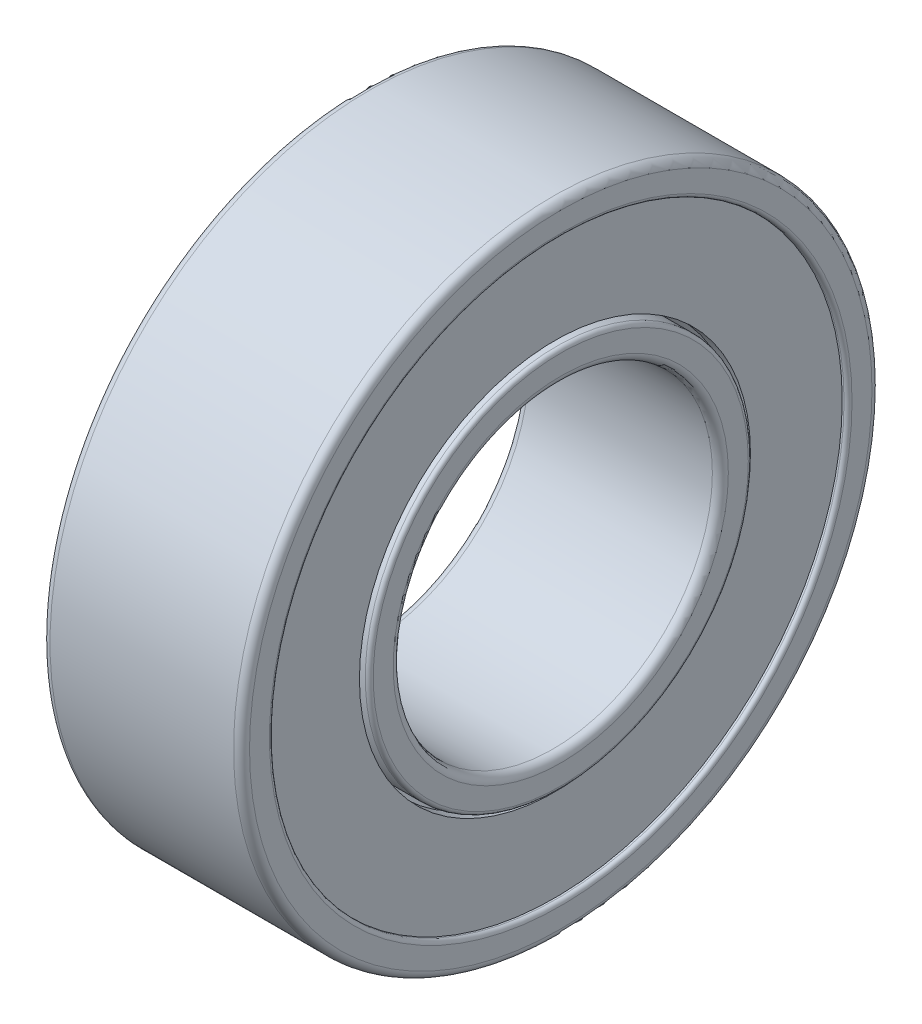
from build123d import *


with BuildPart() as part:
    # Sketch 1 → Revolve 1 (revolve)
    with BuildSketch(Plane.XY, mode=Mode.PRIVATE) as revolve_1_sk:
        with BuildLine():
            Line((2.3, 8), (-2.3, 8))
            ThreePointArc((-2.3, 8), (-2.441421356, 7.941421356), (-2.5, 7.8))
            Line((-2.5, 7.8), (-2.5, 7.3))
            ThreePointArc((-2.5, 7.3), (-2.470710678, 7.229289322), (-2.4, 7.2))
            Line((-2.4, 7.2), (-2.35424104, 7.2))
            Line((-2.35424104, 7.2), (-2.35424104, 4.9))
            Line((-2.35424104, 4.9), (-2.043096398, 4.9))
            Line((-2.043096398, 4.9), (-2.043096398, 7.2))
            Line((-2.043096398, 7.2), (-1.303819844, 7.2))
            ThreePointArc((-1.303819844, 7.2), (-1.737142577, 5.980849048), (-1.208282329, 4.8))
            Line((-1.208282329, 4.8), (-2.4, 4.8))
            ThreePointArc((-2.4, 4.8), (-2.470710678, 4.770710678), (-2.5, 4.7))
            Line((-2.5, 4.7), (-2.5, 4.2))
            ThreePointArc((-2.5, 4.2), (-2.441421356, 4.058578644), (-2.3, 4))
            Line((-2.3, 4), (2.3, 4))
            ThreePointArc((2.3, 4), (2.441421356, 4.058578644), (2.5, 4.2))
            Line((2.5, 4.2), (2.5, 4.7))
            ThreePointArc((2.5, 4.7), (2.470710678, 4.770710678), (2.4, 4.8))
            Line((2.4, 4.8), (1.208282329, 4.8))
            ThreePointArc((1.208282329, 4.8), (1.737142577, 5.980849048), (1.303819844, 7.2))
            Line((1.303819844, 7.2), (2.043096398, 7.2))
            Line((2.043096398, 7.2), (2.043096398, 4.9))
            Line((2.043096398, 4.9), (2.35424104, 4.9))
            Line((2.35424104, 4.9), (2.35424104, 7.2))
            Line((2.35424104, 7.2), (2.4, 7.2))
            ThreePointArc((2.4, 7.2), (2.470710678, 7.229289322), (2.5, 7.3))
            Line((2.5, 7.3), (2.5, 7.8))
            ThreePointArc((2.5, 7.8), (2.441421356, 7.941421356), (2.3, 8))
        make_face()
    revolve(revolve_1_sk.sketch.rotate(Axis((0, 0, 0), (-1, 0, 0)), 90), axis=Axis((0, 0, 0), (-1, 0, 0)))


solid = part.part
